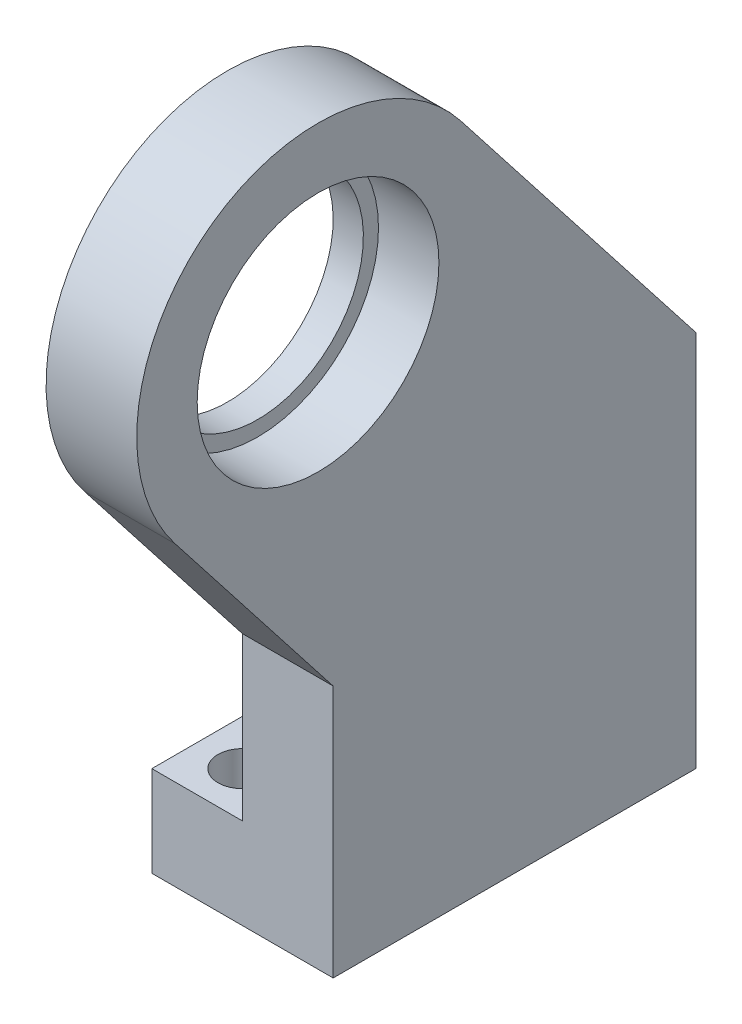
ISO-10303-21;
HEADER;
FILE_DESCRIPTION(('STEP AP214'),'2;1');
FILE_NAME('part.step','',(''),(''),'','','');
FILE_SCHEMA(('AUTOMOTIVE_DESIGN { 1 0 10303 214 1 1 1 1 }'));
ENDSEC;
DATA;
#1=APPLICATION_CONTEXT('core data for automotive mechanical design processes');
#2=APPLICATION_PROTOCOL_DEFINITION('international standard','automotive_design',2000,#1);
#3=PRODUCT_CONTEXT('',#1,'mechanical');
#4=PRODUCT('Part','Part','',(#3));
#5=PRODUCT_RELATED_PRODUCT_CATEGORY('part','',(#4));
#6=PRODUCT_DEFINITION_FORMATION('','',#4);
#7=PRODUCT_DEFINITION_CONTEXT('part definition',#1,'design');
#8=PRODUCT_DEFINITION('design','',#6,#7);
#9=PRODUCT_DEFINITION_SHAPE('','',#8);
#10=(LENGTH_UNIT() NAMED_UNIT(*) SI_UNIT(.MILLI.,.METRE.));
#11=(NAMED_UNIT(*) PLANE_ANGLE_UNIT() SI_UNIT($,.RADIAN.));
#12=(NAMED_UNIT(*) SI_UNIT($,.STERADIAN.) SOLID_ANGLE_UNIT());
#13=UNCERTAINTY_MEASURE_WITH_UNIT(LENGTH_MEASURE(1.E-05),#10,'distance_accuracy_value','');
#14=(GEOMETRIC_REPRESENTATION_CONTEXT(3) GLOBAL_UNCERTAINTY_ASSIGNED_CONTEXT((#13)) GLOBAL_UNIT_ASSIGNED_CONTEXT((#10,
#11,#12)) REPRESENTATION_CONTEXT('',''));
#15=CARTESIAN_POINT('',(0.,0.,0.));
#16=DIRECTION('',(0.,0.,1.));
#17=DIRECTION('',(1.,0.,0.));
#18=AXIS2_PLACEMENT_3D('',#15,#16,#17);
#19=CARTESIAN_POINT('',(-12.,25.,50.));
#20=DIRECTION('',(1.,0.,0.));
#21=DIRECTION('',(0.,1.,0.));
#22=AXIS2_PLACEMENT_3D('',#19,#20,#21);
#23=CYLINDRICAL_SURFACE('',#22,14.);
#24=CARTESIAN_POINT('',(0.,25.,50.));
#25=DIRECTION('',(1.,0.,0.));
#26=DIRECTION('',(0.,1.,0.));
#27=AXIS2_PLACEMENT_3D('',#24,#25,#26);
#28=CIRCLE('',#27,14.);
#29=CARTESIAN_POINT('',(0.,39.,50.));
#30=VERTEX_POINT('',#29);
#31=EDGE_CURVE('E166',#30,#30,#28,.F.);
#32=ORIENTED_EDGE('',*,*,#31,.T.);
#33=EDGE_LOOP('',(#32));
#34=FACE_BOUND('',#33,.T.);
#35=CARTESIAN_POINT('',(3.99999999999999,25.,50.));
#36=DIRECTION('',(1.,0.,0.));
#37=DIRECTION('',(0.,1.,0.));
#38=AXIS2_PLACEMENT_3D('',#35,#36,#37);
#39=CIRCLE('',#38,14.);
#40=CARTESIAN_POINT('',(3.99999999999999,39.,50.));
#41=VERTEX_POINT('',#40);
#42=EDGE_CURVE('E20',#41,#41,#39,.F.);
#43=ORIENTED_EDGE('',*,*,#42,.F.);
#44=EDGE_LOOP('',(#43));
#45=FACE_BOUND('',#44,.T.);
#46=ADVANCED_FACE('F17',(#34,#45),#23,.F.);
#47=CARTESIAN_POINT('',(4.,25.,50.));
#48=DIRECTION('',(1.,0.,0.));
#49=DIRECTION('',(0.,1.,0.));
#50=AXIS2_PLACEMENT_3D('',#47,#48,#49);
#51=PLANE('',#50);
#52=CARTESIAN_POINT('',(4.,25.,50.));
#53=DIRECTION('',(1.,0.,0.));
#54=DIRECTION('',(0.,1.,0.));
#55=AXIS2_PLACEMENT_3D('',#52,#53,#54);
#56=CIRCLE('',#55,16.);
#57=CARTESIAN_POINT('',(3.99999999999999,41.,50.));
#58=VERTEX_POINT('',#57);
#59=EDGE_CURVE('E143',#58,#58,#56,.T.);
#60=ORIENTED_EDGE('',*,*,#59,.T.);
#61=EDGE_LOOP('',(#60));
#62=FACE_BOUND('',#61,.T.);
#63=ORIENTED_EDGE('',*,*,#42,.T.);
#64=EDGE_LOOP('',(#63));
#65=FACE_BOUND('',#64,.T.);
#66=ADVANCED_FACE('F209',(#62,#65),#51,.T.);
#67=CARTESIAN_POINT('',(-6.00000000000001,-50.,42.));
#68=DIRECTION('',(0.,1.,0.));
#69=DIRECTION('',(-1.,0.,0.));
#70=AXIS2_PLACEMENT_3D('',#67,#68,#69);
#71=CYLINDRICAL_SURFACE('',#70,3.25);
#72=CARTESIAN_POINT('',(-6.00000000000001,-50.,42.));
#73=DIRECTION('',(0.,1.,0.));
#74=DIRECTION('',(-1.,0.,0.));
#75=AXIS2_PLACEMENT_3D('',#72,#73,#74);
#76=CIRCLE('',#75,3.25);
#77=CARTESIAN_POINT('',(-9.25000000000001,-50.,42.));
#78=VERTEX_POINT('',#77);
#79=EDGE_CURVE('E180',#78,#78,#76,.F.);
#80=ORIENTED_EDGE('',*,*,#79,.T.);
#81=EDGE_LOOP('',(#80));
#82=FACE_BOUND('',#81,.T.);
#83=CARTESIAN_POINT('',(-5.99999999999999,-38.,42.));
#84=DIRECTION('',(0.,1.,0.));
#85=DIRECTION('',(-1.,0.,0.));
#86=AXIS2_PLACEMENT_3D('',#83,#84,#85);
#87=CIRCLE('',#86,3.25);
#88=CARTESIAN_POINT('',(-9.25,-38.,42.));
#89=VERTEX_POINT('',#88);
#90=EDGE_CURVE('E202',#89,#89,#87,.T.);
#91=ORIENTED_EDGE('',*,*,#90,.T.);
#92=EDGE_LOOP('',(#91));
#93=FACE_BOUND('',#92,.T.);
#94=ADVANCED_FACE('F217',(#82,#93),#71,.F.);
#95=CARTESIAN_POINT('',(-6.00000000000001,-50.,6.));
#96=DIRECTION('',(0.,1.,0.));
#97=DIRECTION('',(-1.,0.,0.));
#98=AXIS2_PLACEMENT_3D('',#95,#96,#97);
#99=CYLINDRICAL_SURFACE('',#98,3.25);
#100=CARTESIAN_POINT('',(-6.00000000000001,-50.,6.));
#101=DIRECTION('',(0.,1.,0.));
#102=DIRECTION('',(-1.,0.,0.));
#103=AXIS2_PLACEMENT_3D('',#100,#101,#102);
#104=CIRCLE('',#103,3.25);
#105=CARTESIAN_POINT('',(-9.25000000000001,-50.,6.));
#106=VERTEX_POINT('',#105);
#107=EDGE_CURVE('E138',#106,#106,#104,.F.);
#108=ORIENTED_EDGE('',*,*,#107,.T.);
#109=EDGE_LOOP('',(#108));
#110=FACE_BOUND('',#109,.T.);
#111=CARTESIAN_POINT('',(-6.,-38.,6.));
#112=DIRECTION('',(0.,1.,0.));
#113=DIRECTION('',(-1.,0.,0.));
#114=AXIS2_PLACEMENT_3D('',#111,#112,#113);
#115=CIRCLE('',#114,3.25);
#116=CARTESIAN_POINT('',(-9.25,-38.,6.));
#117=VERTEX_POINT('',#116);
#118=EDGE_CURVE('E167',#117,#117,#115,.T.);
#119=ORIENTED_EDGE('',*,*,#118,.T.);
#120=EDGE_LOOP('',(#119));
#121=FACE_BOUND('',#120,.T.);
#122=ADVANCED_FACE('F255',(#110,#121),#99,.F.);
#123=CARTESIAN_POINT('',(-12.,-38.,0.));
#124=DIRECTION('',(0.,-1.,0.));
#125=DIRECTION('',(1.,0.,0.));
#126=AXIS2_PLACEMENT_3D('',#123,#124,#125);
#127=PLANE('',#126);
#128=DIRECTION('',(0.,0.,1.));
#129=VECTOR('',#128,1.);
#130=CARTESIAN_POINT('',(0.,-38.,0.));
#131=LINE('',#130,#129);
#132=CARTESIAN_POINT('',(0.,-38.,48.));
#133=VERTEX_POINT('',#132);
#134=CARTESIAN_POINT('',(0.,-38.,0.));
#135=VERTEX_POINT('',#134);
#136=EDGE_CURVE('E173',#133,#135,#131,.F.);
#137=ORIENTED_EDGE('',*,*,#136,.T.);
#138=DIRECTION('',(1.,0.,0.));
#139=VECTOR('',#138,1.);
#140=CARTESIAN_POINT('',(0.,-38.,0.));
#141=LINE('',#140,#139);
#142=CARTESIAN_POINT('',(-12.,-38.,0.));
#143=VERTEX_POINT('',#142);
#144=EDGE_CURVE('E142',#135,#143,#141,.F.);
#145=ORIENTED_EDGE('',*,*,#144,.T.);
#146=DIRECTION('',(0.,0.,1.));
#147=VECTOR('',#146,1.);
#148=CARTESIAN_POINT('',(-12.,-38.,100.));
#149=LINE('',#148,#147);
#150=CARTESIAN_POINT('',(-12.,-38.,48.));
#151=VERTEX_POINT('',#150);
#152=EDGE_CURVE('E164',#143,#151,#149,.T.);
#153=ORIENTED_EDGE('',*,*,#152,.T.);
#154=DIRECTION('',(1.,0.,0.));
#155=VECTOR('',#154,1.);
#156=CARTESIAN_POINT('',(-12.,-38.,48.));
#157=LINE('',#156,#155);
#158=EDGE_CURVE('E78',#133,#151,#157,.F.);
#159=ORIENTED_EDGE('',*,*,#158,.F.);
#160=EDGE_LOOP('',(#137,#145,#153,#159));
#161=FACE_BOUND('',#160,.T.);
#162=ORIENTED_EDGE('',*,*,#118,.F.);
#163=EDGE_LOOP('',(#162));
#164=FACE_BOUND('',#163,.T.);
#165=ORIENTED_EDGE('',*,*,#90,.F.);
#166=EDGE_LOOP('',(#165));
#167=FACE_BOUND('',#166,.T.);
#168=ADVANCED_FACE('F251',(#161,#164,#167),#127,.F.);
#169=CARTESIAN_POINT('',(-12.,50.,100.));
#170=DIRECTION('',(1.,0.,0.));
#171=DIRECTION('',(0.,1.,0.));
#172=AXIS2_PLACEMENT_3D('',#169,#170,#171);
#173=PLANE('',#172);
#174=ORIENTED_EDGE('',*,*,#152,.F.);
#175=DIRECTION('',(0.,1.,0.));
#176=VECTOR('',#175,1.);
#177=CARTESIAN_POINT('',(-12.,0.,0.));
#178=LINE('',#177,#176);
#179=CARTESIAN_POINT('',(-12.,-50.,0.));
#180=VERTEX_POINT('',#179);
#181=EDGE_CURVE('E177',#143,#180,#178,.F.);
#182=ORIENTED_EDGE('',*,*,#181,.T.);
#183=DIRECTION('',(0.,0.,1.));
#184=VECTOR('',#183,1.);
#185=CARTESIAN_POINT('',(-12.,-50.,100.));
#186=LINE('',#185,#184);
#187=CARTESIAN_POINT('',(-12.,-50.,48.));
#188=VERTEX_POINT('',#187);
#189=EDGE_CURVE('E137',#180,#188,#186,.T.);
#190=ORIENTED_EDGE('',*,*,#189,.T.);
#191=DIRECTION('',(0.,1.,0.));
#192=VECTOR('',#191,1.);
#193=CARTESIAN_POINT('',(-12.,-50.,48.));
#194=LINE('',#193,#192);
#195=EDGE_CURVE('E83',#151,#188,#194,.F.);
#196=ORIENTED_EDGE('',*,*,#195,.F.);
#197=EDGE_LOOP('',(#174,#182,#190,#196));
#198=FACE_BOUND('',#197,.T.);
#199=ADVANCED_FACE('F247',(#198),#173,.F.);
#200=CARTESIAN_POINT('',(0.,50.,0.));
#201=DIRECTION('',(1.,0.,0.));
#202=DIRECTION('',(0.,1.,0.));
#203=AXIS2_PLACEMENT_3D('',#200,#201,#202);
#204=PLANE('',#203);
#205=DIRECTION('',(0.,1.,0.));
#206=VECTOR('',#205,1.);
#207=CARTESIAN_POINT('',(0.,0.,0.));
#208=LINE('',#207,#206);
#209=CARTESIAN_POINT('',(0.,0.,0.));
#210=VERTEX_POINT('',#209);
#211=EDGE_CURVE('E59',#210,#135,#208,.F.);
#212=ORIENTED_EDGE('',*,*,#211,.T.);
#213=ORIENTED_EDGE('',*,*,#136,.F.);
#214=DIRECTION('',(0.,1.,0.));
#215=VECTOR('',#214,1.);
#216=CARTESIAN_POINT('',(0.,-50.,48.));
#217=LINE('',#216,#215);
#218=CARTESIAN_POINT('',(0.,-16.5325117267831,48.));
#219=VERTEX_POINT('',#218);
#220=EDGE_CURVE('E154',#219,#133,#217,.F.);
#221=ORIENTED_EDGE('',*,*,#220,.F.);
#222=DIRECTION('',(0.,-0.787900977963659,-0.615801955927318));
#223=VECTOR('',#222,1.);
#224=CARTESIAN_POINT('',(0.,-16.5325117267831,48.));
#225=LINE('',#224,#223);
#226=CARTESIAN_POINT('',(0.,10.2207530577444,68.9096234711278));
#227=VERTEX_POINT('',#226);
#228=EDGE_CURVE('E111',#227,#219,#225,.T.);
#229=ORIENTED_EDGE('',*,*,#228,.F.);
#230=CARTESIAN_POINT('',(0.,25.,50.));
#231=DIRECTION('',(1.,0.,0.));
#232=DIRECTION('',(0.,1.,0.));
#233=AXIS2_PLACEMENT_3D('',#230,#231,#232);
#234=CIRCLE('',#233,24.);
#235=CARTESIAN_POINT('',(0.,39.7792469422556,31.0903765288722));
#236=VERTEX_POINT('',#235);
#237=EDGE_CURVE('E148',#236,#227,#234,.T.);
#238=ORIENTED_EDGE('',*,*,#237,.F.);
#239=DIRECTION('',(0.,0.787900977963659,0.615801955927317));
#240=VECTOR('',#239,1.);
#241=CARTESIAN_POINT('',(0.,39.7792469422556,31.0903765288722));
#242=LINE('',#241,#240);
#243=EDGE_CURVE('E48',#210,#236,#242,.T.);
#244=ORIENTED_EDGE('',*,*,#243,.F.);
#245=EDGE_LOOP('',(#212,#213,#221,#229,#238,#244));
#246=FACE_BOUND('',#245,.T.);
#247=ORIENTED_EDGE('',*,*,#31,.F.);
#248=EDGE_LOOP('',(#247));
#249=FACE_BOUND('',#248,.T.);
#250=ADVANCED_FACE('F243',(#246,#249),#204,.F.);
#251=CARTESIAN_POINT('',(4.,25.,50.));
#252=DIRECTION('',(1.,0.,0.));
#253=DIRECTION('',(0.,1.,0.));
#254=AXIS2_PLACEMENT_3D('',#251,#252,#253);
#255=CYLINDRICAL_SURFACE('',#254,16.);
#256=ORIENTED_EDGE('',*,*,#59,.F.);
#257=EDGE_LOOP('',(#256));
#258=FACE_BOUND('',#257,.T.);
#259=CARTESIAN_POINT('',(12.,25.,50.));
#260=DIRECTION('',(1.,0.,0.));
#261=DIRECTION('',(0.,1.,0.));
#262=AXIS2_PLACEMENT_3D('',#259,#260,#261);
#263=CIRCLE('',#262,16.);
#264=CARTESIAN_POINT('',(12.,41.,50.));
#265=VERTEX_POINT('',#264);
#266=EDGE_CURVE('E188',#265,#265,#263,.T.);
#267=ORIENTED_EDGE('',*,*,#266,.T.);
#268=EDGE_LOOP('',(#267));
#269=FACE_BOUND('',#268,.T.);
#270=ADVANCED_FACE('F240',(#258,#269),#255,.F.);
#271=CARTESIAN_POINT('',(0.,0.,0.));
#272=DIRECTION('',(0.,0.,1.));
#273=DIRECTION('',(1.,0.,0.));
#274=AXIS2_PLACEMENT_3D('',#271,#272,#273);
#275=PLANE('',#274);
#276=DIRECTION('',(0.,-1.,0.));
#277=VECTOR('',#276,1.);
#278=CARTESIAN_POINT('',(12.,50.,0.));
#279=LINE('',#278,#277);
#280=CARTESIAN_POINT('',(12.,0.,0.));
#281=VERTEX_POINT('',#280);
#282=CARTESIAN_POINT('',(12.,-50.,0.));
#283=VERTEX_POINT('',#282);
#284=EDGE_CURVE('E124',#281,#283,#279,.T.);
#285=ORIENTED_EDGE('',*,*,#284,.T.);
#286=DIRECTION('',(1.,0.,0.));
#287=VECTOR('',#286,1.);
#288=CARTESIAN_POINT('',(-12.,-50.,0.));
#289=LINE('',#288,#287);
#290=EDGE_CURVE('E94',#283,#180,#289,.F.);
#291=ORIENTED_EDGE('',*,*,#290,.T.);
#292=ORIENTED_EDGE('',*,*,#181,.F.);
#293=ORIENTED_EDGE('',*,*,#144,.F.);
#294=ORIENTED_EDGE('',*,*,#211,.F.);
#295=DIRECTION('',(1.,0.,0.));
#296=VECTOR('',#295,1.);
#297=CARTESIAN_POINT('',(-12.,0.,0.));
#298=LINE('',#297,#296);
#299=EDGE_CURVE('E191',#281,#210,#298,.F.);
#300=ORIENTED_EDGE('',*,*,#299,.F.);
#301=EDGE_LOOP('',(#285,#291,#292,#293,#294,#300));
#302=FACE_BOUND('',#301,.T.);
#303=ADVANCED_FACE('F237',(#302),#275,.F.);
#304=CARTESIAN_POINT('',(-12.,-50.,100.));
#305=DIRECTION('',(0.,1.,0.));
#306=DIRECTION('',(0.,0.,1.));
#307=AXIS2_PLACEMENT_3D('',#304,#305,#306);
#308=PLANE('',#307);
#309=ORIENTED_EDGE('',*,*,#189,.F.);
#310=ORIENTED_EDGE('',*,*,#290,.F.);
#311=DIRECTION('',(0.,0.,1.));
#312=VECTOR('',#311,1.);
#313=CARTESIAN_POINT('',(12.,-50.,100.));
#314=LINE('',#313,#312);
#315=CARTESIAN_POINT('',(12.,-50.,48.));
#316=VERTEX_POINT('',#315);
#317=EDGE_CURVE('E122',#283,#316,#314,.T.);
#318=ORIENTED_EDGE('',*,*,#317,.T.);
#319=DIRECTION('',(1.,0.,0.));
#320=VECTOR('',#319,1.);
#321=CARTESIAN_POINT('',(-12.,-50.,48.));
#322=LINE('',#321,#320);
#323=EDGE_CURVE('E98',#188,#316,#322,.T.);
#324=ORIENTED_EDGE('',*,*,#323,.F.);
#325=EDGE_LOOP('',(#309,#310,#318,#324));
#326=FACE_BOUND('',#325,.T.);
#327=ORIENTED_EDGE('',*,*,#107,.F.);
#328=EDGE_LOOP('',(#327));
#329=FACE_BOUND('',#328,.T.);
#330=ORIENTED_EDGE('',*,*,#79,.F.);
#331=EDGE_LOOP('',(#330));
#332=FACE_BOUND('',#331,.T.);
#333=ADVANCED_FACE('F234',(#326,#329,#332),#308,.F.);
#334=CARTESIAN_POINT('',(-12.,-50.,48.));
#335=DIRECTION('',(0.,0.,1.));
#336=DIRECTION('',(1.,0.,0.));
#337=AXIS2_PLACEMENT_3D('',#334,#335,#336);
#338=PLANE('',#337);
#339=DIRECTION('',(0.,-1.,0.));
#340=VECTOR('',#339,1.);
#341=CARTESIAN_POINT('',(12.,50.,48.));
#342=LINE('',#341,#340);
#343=CARTESIAN_POINT('',(12.,-16.5325117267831,48.));
#344=VERTEX_POINT('',#343);
#345=EDGE_CURVE('E119',#316,#344,#342,.F.);
#346=ORIENTED_EDGE('',*,*,#345,.T.);
#347=DIRECTION('',(1.,0.,0.));
#348=VECTOR('',#347,1.);
#349=CARTESIAN_POINT('',(-12.,-16.5325117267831,48.));
#350=LINE('',#349,#348);
#351=EDGE_CURVE('E105',#219,#344,#350,.T.);
#352=ORIENTED_EDGE('',*,*,#351,.F.);
#353=ORIENTED_EDGE('',*,*,#220,.T.);
#354=ORIENTED_EDGE('',*,*,#158,.T.);
#355=ORIENTED_EDGE('',*,*,#195,.T.);
#356=ORIENTED_EDGE('',*,*,#323,.T.);
#357=EDGE_LOOP('',(#346,#352,#353,#354,#355,#356));
#358=FACE_BOUND('',#357,.T.);
#359=ADVANCED_FACE('F121',(#358),#338,.T.);
#360=CARTESIAN_POINT('',(-12.,-16.5325117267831,48.));
#361=DIRECTION('',(0.,-0.615801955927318,0.787900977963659));
#362=DIRECTION('',(0.,-0.787900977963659,-0.615801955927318));
#363=AXIS2_PLACEMENT_3D('',#360,#361,#362);
#364=PLANE('',#363);
#365=DIRECTION('',(0.,0.787900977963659,0.615801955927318));
#366=VECTOR('',#365,1.);
#367=CARTESIAN_POINT('',(12.,-16.5325117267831,48.));
#368=LINE('',#367,#366);
#369=CARTESIAN_POINT('',(12.,10.2207530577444,68.9096234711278));
#370=VERTEX_POINT('',#369);
#371=EDGE_CURVE('E109',#344,#370,#368,.T.);
#372=ORIENTED_EDGE('',*,*,#371,.T.);
#373=DIRECTION('',(1.,0.,0.));
#374=VECTOR('',#373,1.);
#375=CARTESIAN_POINT('',(-12.,10.2207530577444,68.9096234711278));
#376=LINE('',#375,#374);
#377=EDGE_CURVE('E113',#227,#370,#376,.T.);
#378=ORIENTED_EDGE('',*,*,#377,.F.);
#379=ORIENTED_EDGE('',*,*,#228,.T.);
#380=ORIENTED_EDGE('',*,*,#351,.T.);
#381=EDGE_LOOP('',(#372,#378,#379,#380));
#382=FACE_BOUND('',#381,.T.);
#383=ADVANCED_FACE('F107',(#382),#364,.T.);
#384=CARTESIAN_POINT('',(-12.,25.,50.));
#385=DIRECTION('',(1.,0.,0.));
#386=DIRECTION('',(0.,1.,0.));
#387=AXIS2_PLACEMENT_3D('',#384,#385,#386);
#388=CYLINDRICAL_SURFACE('',#387,24.);
#389=CARTESIAN_POINT('',(12.,25.,50.));
#390=DIRECTION('',(1.,0.,0.));
#391=DIRECTION('',(0.,1.,0.));
#392=AXIS2_PLACEMENT_3D('',#389,#390,#391);
#393=CIRCLE('',#392,24.);
#394=CARTESIAN_POINT('',(12.,39.7792469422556,31.0903765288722));
#395=VERTEX_POINT('',#394);
#396=EDGE_CURVE('E26',#370,#395,#393,.F.);
#397=ORIENTED_EDGE('',*,*,#396,.T.);
#398=DIRECTION('',(1.,0.,0.));
#399=VECTOR('',#398,1.);
#400=CARTESIAN_POINT('',(-12.,39.7792469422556,31.0903765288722));
#401=LINE('',#400,#399);
#402=EDGE_CURVE('E147',#236,#395,#401,.T.);
#403=ORIENTED_EDGE('',*,*,#402,.F.);
#404=ORIENTED_EDGE('',*,*,#237,.T.);
#405=ORIENTED_EDGE('',*,*,#377,.T.);
#406=EDGE_LOOP('',(#397,#403,#404,#405));
#407=FACE_BOUND('',#406,.T.);
#408=ADVANCED_FACE('F225',(#407),#388,.T.);
#409=CARTESIAN_POINT('',(-12.,39.7792469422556,31.0903765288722));
#410=DIRECTION('',(0.,0.615801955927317,-0.787900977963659));
#411=DIRECTION('',(0.,0.787900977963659,0.615801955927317));
#412=AXIS2_PLACEMENT_3D('',#409,#410,#411);
#413=PLANE('',#412);
#414=DIRECTION('',(0.,-0.787900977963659,-0.615801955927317));
#415=VECTOR('',#414,1.);
#416=CARTESIAN_POINT('',(12.,39.7792469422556,31.0903765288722));
#417=LINE('',#416,#415);
#418=EDGE_CURVE('E11',#395,#281,#417,.T.);
#419=ORIENTED_EDGE('',*,*,#418,.T.);
#420=ORIENTED_EDGE('',*,*,#299,.T.);
#421=ORIENTED_EDGE('',*,*,#243,.T.);
#422=ORIENTED_EDGE('',*,*,#402,.T.);
#423=EDGE_LOOP('',(#419,#420,#421,#422));
#424=FACE_BOUND('',#423,.T.);
#425=ADVANCED_FACE('F220',(#424),#413,.T.);
#426=CARTESIAN_POINT('',(12.,50.,100.));
#427=DIRECTION('',(-1.,0.,0.));
#428=DIRECTION('',(0.,-1.,0.));
#429=AXIS2_PLACEMENT_3D('',#426,#427,#428);
#430=PLANE('',#429);
#431=ORIENTED_EDGE('',*,*,#418,.F.);
#432=ORIENTED_EDGE('',*,*,#396,.F.);
#433=ORIENTED_EDGE('',*,*,#371,.F.);
#434=ORIENTED_EDGE('',*,*,#345,.F.);
#435=ORIENTED_EDGE('',*,*,#317,.F.);
#436=ORIENTED_EDGE('',*,*,#284,.F.);
#437=EDGE_LOOP('',(#431,#432,#433,#434,#435,#436));
#438=FACE_BOUND('',#437,.T.);
#439=ORIENTED_EDGE('',*,*,#266,.F.);
#440=EDGE_LOOP('',(#439));
#441=FACE_BOUND('',#440,.T.);
#442=ADVANCED_FACE('F117',(#438,#441),#430,.F.);
#443=CLOSED_SHELL('',(#46,#66,#94,#122,#168,#199,#250,#270,#303,#333,#359,#383,#408,#425,#442));
#444=MANIFOLD_SOLID_BREP('B1',#443);
#445=ADVANCED_BREP_SHAPE_REPRESENTATION('',(#18,#444),#14);
#446=SHAPE_DEFINITION_REPRESENTATION(#9,#445);
ENDSEC;
END-ISO-10303-21;
